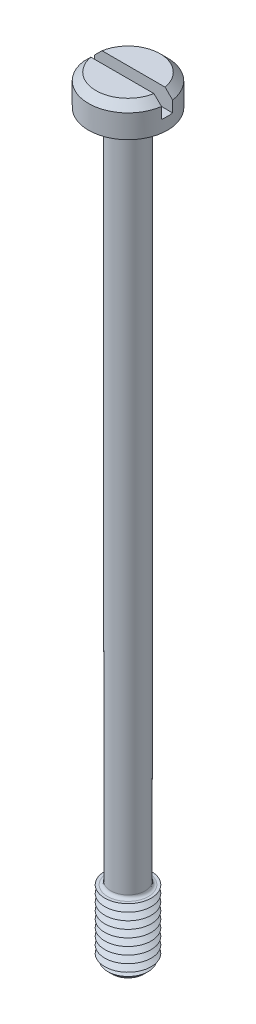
from build123d import *

# Parameters (mm, degrees)
SKETCH1_R           = 4.25
BOSS_EXTRUDE1_DEPTH = 3.3
SKETCH2_R           = 1.85
BOSS_EXTRUDE2_DEPTH = 80
SKETCH3_R           = 2.5
BOSS_EXTRUDE3_DEPTH = 7.5
CHAMFER1_SIZE       = 0.8
LPATTERN1_COUNT     = 9
LPATTERN1_PITCH     = 0.8
FILLET1_R           = 0.35
CHAMFER2_SIZE       = 0.8
SKETCH6_W           = 8.5
SKETCH6_H           = 1.2
CUT_EXTRUDE1_DEPTH  = 2


with BuildPart() as part:
    # Sketch1 → Boss-Extrude1 (new body)
    with BuildSketch(Plane(origin=(0, 0, 0), x_dir=(1, 0, 0), z_dir=(0, 1, 0))):
        with Locations(Location((0, 0, 0), (0, 0, 270))):
            Circle(SKETCH1_R)
    extrude(amount=BOSS_EXTRUDE1_DEPTH)

    # Sketch2 → Boss-Extrude2 (add)
    with BuildSketch(Plane.XZ):
        with Locations(Location((0, 0, 0), (0, 0, 270))):
            Circle(SKETCH2_R)
    extrude(amount=BOSS_EXTRUDE2_DEPTH)

    # Sketch3 → Boss-Extrude3 (add)
    with BuildSketch(Plane.XZ.offset(80)):
        with Locations(Location((0, 0, 0), (0, 0, 270))):
            Circle(SKETCH3_R)
    extrude(amount=-BOSS_EXTRUDE3_DEPTH)

    # Chamfer1
    chamfer1_edges = [part.edges().sort_by_distance(p)[0] for p in [
        (0, -80, 2.5),
    ]]
    chamfer(chamfer1_edges, length=CHAMFER1_SIZE)

    # Sketch5 → Cut-Revolve1 (revolve, cut)
    with BuildSketch(Plane(origin=(0, 0, 0), x_dir=(0, 0, -1), z_dir=(1, 0, 0))):
        Polygon((-2.5, -72.5), (-1.807179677, -72.9), (-2.5, -73.3), align=None)
    cut_revolve1 = revolve(axis=Axis((0, -6.58711856, 0), (0, -1, 0)), mode=Mode.SUBTRACT)

    # LPattern1: Cut-Revolve1 ×9
    with Locations(*[(0, -i * LPATTERN1_PITCH, 0) for i in range(1, LPATTERN1_COUNT)]):
        add(cut_revolve1, mode=Mode.SUBTRACT)

    # Fillet1
    fillet1_edges = [part.edges().sort_by_distance(p)[0] for p in [
        (0, 0, 1.85),
        (0, -72.5, 1.85),
    ]]
    fillet(fillet1_edges, radius=FILLET1_R)

    # Chamfer2
    chamfer2_edges = [part.edges().sort_by_distance(p)[0] for p in [
        (0, 3.3, -4.25),
    ]]
    chamfer(chamfer2_edges, length=CHAMFER2_SIZE)

    # Sketch6 → Cut-Extrude1 (cut)
    with BuildSketch(Plane(origin=(0, 3.3, 0), x_dir=(1, 0, 0), z_dir=(0, 1, 0))):
        Rectangle(SKETCH6_W, SKETCH6_H)
    extrude(amount=-CUT_EXTRUDE1_DEPTH, mode=Mode.SUBTRACT)


solid = part.part
